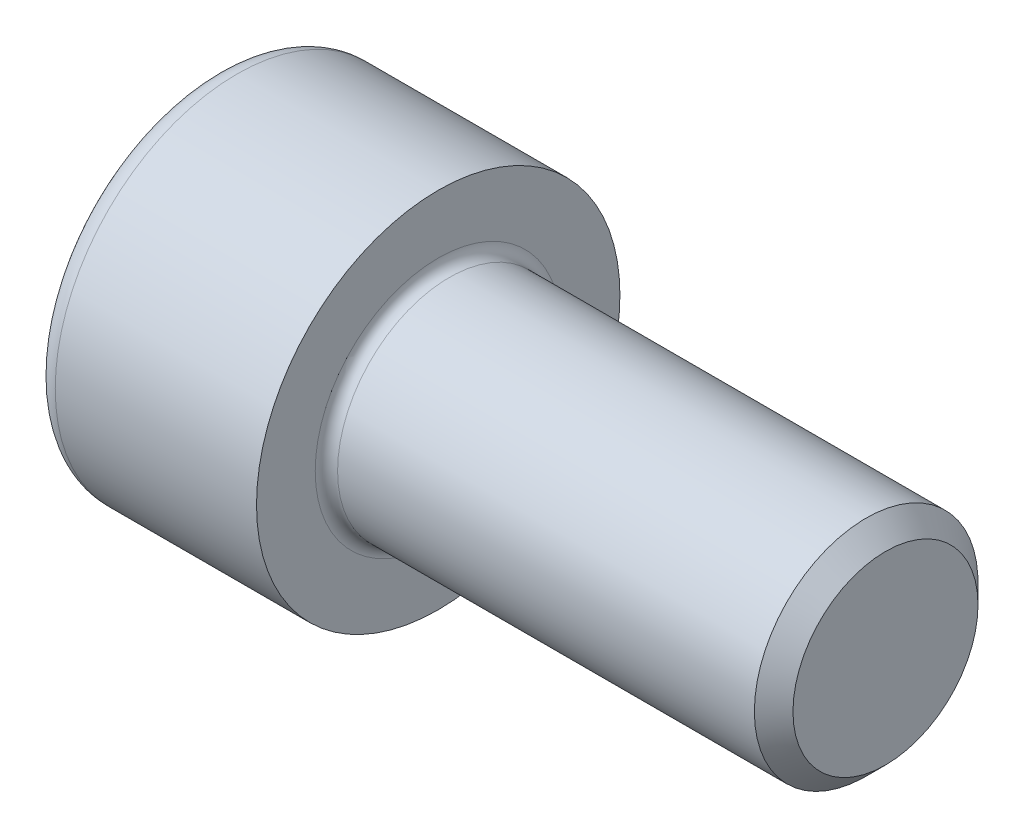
ISO-10303-21;
HEADER;
FILE_DESCRIPTION(('STEP AP214'),'2;1');
FILE_NAME('part.step','',(''),(''),'','','');
FILE_SCHEMA(('AUTOMOTIVE_DESIGN { 1 0 10303 214 1 1 1 1 }'));
ENDSEC;
DATA;
#1=APPLICATION_CONTEXT('core data for automotive mechanical design processes');
#2=APPLICATION_PROTOCOL_DEFINITION('international standard','automotive_design',2000,#1);
#3=PRODUCT_CONTEXT('',#1,'mechanical');
#4=PRODUCT('Part','Part','',(#3));
#5=PRODUCT_RELATED_PRODUCT_CATEGORY('part','',(#4));
#6=PRODUCT_DEFINITION_FORMATION('','',#4);
#7=PRODUCT_DEFINITION_CONTEXT('part definition',#1,'design');
#8=PRODUCT_DEFINITION('design','',#6,#7);
#9=PRODUCT_DEFINITION_SHAPE('','',#8);
#10=(LENGTH_UNIT() NAMED_UNIT(*) SI_UNIT(.MILLI.,.METRE.));
#11=(NAMED_UNIT(*) PLANE_ANGLE_UNIT() SI_UNIT($,.RADIAN.));
#12=(NAMED_UNIT(*) SI_UNIT($,.STERADIAN.) SOLID_ANGLE_UNIT());
#13=UNCERTAINTY_MEASURE_WITH_UNIT(LENGTH_MEASURE(1.E-05),#10,'distance_accuracy_value','');
#14=(GEOMETRIC_REPRESENTATION_CONTEXT(3) GLOBAL_UNCERTAINTY_ASSIGNED_CONTEXT((#13)) GLOBAL_UNIT_ASSIGNED_CONTEXT((#10,
#11,#12)) REPRESENTATION_CONTEXT('',''));
#15=CARTESIAN_POINT('',(0.,0.,0.));
#16=DIRECTION('',(0.,0.,1.));
#17=DIRECTION('',(1.,0.,0.));
#18=AXIS2_PLACEMENT_3D('',#15,#16,#17);
#19=CARTESIAN_POINT('',(0.,0.,0.));
#20=DIRECTION('',(-1.,0.,0.));
#21=DIRECTION('',(0.,0.,1.));
#22=AXIS2_PLACEMENT_3D('',#19,#20,#21);
#23=PLANE('',#22);
#24=DIRECTION('',(0.,-0.499999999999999,0.866025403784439));
#25=VECTOR('',#24,1.);
#26=CARTESIAN_POINT('',(0.,3.47564862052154,0.));
#27=LINE('',#26,#25);
#28=CARTESIAN_POINT('',(0.,3.47564862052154,0.));
#29=VERTEX_POINT('',#28);
#30=CARTESIAN_POINT('',(0.,1.73782431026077,3.00999999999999));
#31=VERTEX_POINT('',#30);
#32=EDGE_CURVE('E295',#29,#31,#27,.T.);
#33=ORIENTED_EDGE('',*,*,#32,.T.);
#34=DIRECTION('',(0.,1.,0.));
#35=VECTOR('',#34,1.);
#36=CARTESIAN_POINT('',(0.,-1.73782431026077,3.01));
#37=LINE('',#36,#35);
#38=CARTESIAN_POINT('',(0.,-1.73782431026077,3.01));
#39=VERTEX_POINT('',#38);
#40=EDGE_CURVE('E139',#39,#31,#37,.T.);
#41=ORIENTED_EDGE('',*,*,#40,.F.);
#42=DIRECTION('',(0.,-0.500000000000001,-0.866025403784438));
#43=VECTOR('',#42,1.);
#44=CARTESIAN_POINT('',(0.,-1.73782431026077,3.01));
#45=LINE('',#44,#43);
#46=CARTESIAN_POINT('',(0.,-3.47564862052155,0.));
#47=VERTEX_POINT('',#46);
#48=EDGE_CURVE('E300',#39,#47,#45,.T.);
#49=ORIENTED_EDGE('',*,*,#48,.T.);
#50=DIRECTION('',(0.,0.499999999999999,-0.866025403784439));
#51=VECTOR('',#50,1.);
#52=CARTESIAN_POINT('',(0.,-3.47564862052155,0.));
#53=LINE('',#52,#51);
#54=CARTESIAN_POINT('',(0.,-1.73782431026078,-3.01));
#55=VERTEX_POINT('',#54);
#56=EDGE_CURVE('E304',#47,#55,#53,.T.);
#57=ORIENTED_EDGE('',*,*,#56,.T.);
#58=DIRECTION('',(0.,-1.,0.));
#59=VECTOR('',#58,1.);
#60=CARTESIAN_POINT('',(0.,1.73782431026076,-3.01));
#61=LINE('',#60,#59);
#62=CARTESIAN_POINT('',(0.,1.73782431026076,-3.01));
#63=VERTEX_POINT('',#62);
#64=EDGE_CURVE('E308',#63,#55,#61,.T.);
#65=ORIENTED_EDGE('',*,*,#64,.F.);
#66=DIRECTION('',(0.,-0.500000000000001,-0.866025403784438));
#67=VECTOR('',#66,1.);
#68=CARTESIAN_POINT('',(0.,3.47564862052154,0.));
#69=LINE('',#68,#67);
#70=EDGE_CURVE('E134',#29,#63,#69,.T.);
#71=ORIENTED_EDGE('',*,*,#70,.F.);
#72=EDGE_LOOP('',(#33,#41,#49,#57,#65,#71));
#73=FACE_BOUND('',#72,.T.);
#74=CARTESIAN_POINT('',(0.,0.,0.));
#75=DIRECTION('',(-1.,0.,0.));
#76=DIRECTION('',(0.,0.,1.));
#77=AXIS2_PLACEMENT_3D('',#74,#75,#76);
#78=CIRCLE('',#77,5.7);
#79=CARTESIAN_POINT('',(0.,0.,5.7));
#80=VERTEX_POINT('',#79);
#81=EDGE_CURVE('E53',#80,#80,#78,.T.);
#82=ORIENTED_EDGE('',*,*,#81,.T.);
#83=EDGE_LOOP('',(#82));
#84=FACE_BOUND('',#83,.T.);
#85=ADVANCED_FACE('F44',(#73,#84),#23,.T.);
#86=CARTESIAN_POINT('',(-31.75,0.,0.));
#87=DIRECTION('',(-1.,0.,0.));
#88=DIRECTION('',(0.,0.,1.));
#89=AXIS2_PLACEMENT_3D('',#86,#87,#88);
#90=CYLINDRICAL_SURFACE('',#89,6.5);
#91=CARTESIAN_POINT('',(0.800000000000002,0.,0.));
#92=DIRECTION('',(-1.,0.,0.));
#93=DIRECTION('',(0.,0.,1.));
#94=AXIS2_PLACEMENT_3D('',#91,#92,#93);
#95=CIRCLE('',#94,6.5);
#96=CARTESIAN_POINT('',(0.800000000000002,0.,6.5));
#97=VERTEX_POINT('',#96);
#98=EDGE_CURVE('E11',#97,#97,#95,.F.);
#99=ORIENTED_EDGE('',*,*,#98,.T.);
#100=EDGE_LOOP('',(#99));
#101=FACE_BOUND('',#100,.T.);
#102=CARTESIAN_POINT('',(8.,0.,0.));
#103=DIRECTION('',(-1.,0.,0.));
#104=DIRECTION('',(0.,0.,1.));
#105=AXIS2_PLACEMENT_3D('',#102,#103,#104);
#106=CIRCLE('',#105,6.5);
#107=CARTESIAN_POINT('',(8.,0.,6.5));
#108=VERTEX_POINT('',#107);
#109=EDGE_CURVE('E163',#108,#108,#106,.T.);
#110=ORIENTED_EDGE('',*,*,#109,.T.);
#111=EDGE_LOOP('',(#110));
#112=FACE_BOUND('',#111,.T.);
#113=ADVANCED_FACE('F191',(#101,#112),#90,.T.);
#114=CARTESIAN_POINT('',(8.,6.5,0.));
#115=DIRECTION('',(1.,0.,0.));
#116=DIRECTION('',(0.,0.,-1.));
#117=AXIS2_PLACEMENT_3D('',#114,#115,#116);
#118=PLANE('',#117);
#119=CARTESIAN_POINT('',(8.,0.,0.));
#120=DIRECTION('',(1.,0.,0.));
#121=DIRECTION('',(0.,0.,-1.));
#122=AXIS2_PLACEMENT_3D('',#119,#120,#121);
#123=CIRCLE('',#122,4.4);
#124=CARTESIAN_POINT('',(8.,0.,-4.4));
#125=VERTEX_POINT('',#124);
#126=EDGE_CURVE('E167',#125,#125,#123,.F.);
#127=ORIENTED_EDGE('',*,*,#126,.T.);
#128=EDGE_LOOP('',(#127));
#129=FACE_BOUND('',#128,.T.);
#130=ORIENTED_EDGE('',*,*,#109,.F.);
#131=EDGE_LOOP('',(#130));
#132=FACE_BOUND('',#131,.T.);
#133=ADVANCED_FACE('F197',(#129,#132),#118,.T.);
#134=CARTESIAN_POINT('',(-31.75,0.,0.));
#135=DIRECTION('',(-1.,0.,0.));
#136=DIRECTION('',(0.,0.,1.));
#137=AXIS2_PLACEMENT_3D('',#134,#135,#136);
#138=CYLINDRICAL_SURFACE('',#137,4.);
#139=CARTESIAN_POINT('',(8.4,0.,0.));
#140=DIRECTION('',(1.,0.,0.));
#141=DIRECTION('',(0.,0.,-1.));
#142=AXIS2_PLACEMENT_3D('',#139,#140,#141);
#143=CIRCLE('',#142,4.);
#144=CARTESIAN_POINT('',(8.4,0.,-4.));
#145=VERTEX_POINT('',#144);
#146=EDGE_CURVE('E171',#145,#145,#143,.T.);
#147=ORIENTED_EDGE('',*,*,#146,.T.);
#148=EDGE_LOOP('',(#147));
#149=FACE_BOUND('',#148,.T.);
#150=CARTESIAN_POINT('',(23.3095,0.,0.));
#151=DIRECTION('',(-1.,0.,0.));
#152=DIRECTION('',(0.,0.,1.));
#153=AXIS2_PLACEMENT_3D('',#150,#151,#152);
#154=CIRCLE('',#153,4.);
#155=CARTESIAN_POINT('',(23.3095,0.,4.));
#156=VERTEX_POINT('',#155);
#157=EDGE_CURVE('E159',#156,#156,#154,.T.);
#158=ORIENTED_EDGE('',*,*,#157,.T.);
#159=EDGE_LOOP('',(#158));
#160=FACE_BOUND('',#159,.T.);
#161=ADVANCED_FACE('F203',(#149,#160),#138,.T.);
#162=CARTESIAN_POINT('',(24.,0.,0.));
#163=DIRECTION('',(-1.,0.,0.));
#164=DIRECTION('',(0.,0.,1.));
#165=AXIS2_PLACEMENT_3D('',#162,#163,#164);
#166=CONICAL_SURFACE('',#165,3.3095,0.785398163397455);
#167=ORIENTED_EDGE('',*,*,#157,.F.);
#168=EDGE_LOOP('',(#167));
#169=FACE_BOUND('',#168,.T.);
#170=CARTESIAN_POINT('',(24.,0.,0.));
#171=DIRECTION('',(-1.,0.,0.));
#172=DIRECTION('',(0.,0.,1.));
#173=AXIS2_PLACEMENT_3D('',#170,#171,#172);
#174=CIRCLE('',#173,3.3095);
#175=CARTESIAN_POINT('',(24.,0.,3.3095));
#176=VERTEX_POINT('',#175);
#177=EDGE_CURVE('E154',#176,#176,#174,.T.);
#178=ORIENTED_EDGE('',*,*,#177,.T.);
#179=EDGE_LOOP('',(#178));
#180=FACE_BOUND('',#179,.T.);
#181=ADVANCED_FACE('F207',(#169,#180),#166,.T.);
#182=CARTESIAN_POINT('',(24.,3.3095,0.));
#183=DIRECTION('',(1.,0.,0.));
#184=DIRECTION('',(0.,0.,-1.));
#185=AXIS2_PLACEMENT_3D('',#182,#183,#184);
#186=PLANE('',#185);
#187=ORIENTED_EDGE('',*,*,#177,.F.);
#188=EDGE_LOOP('',(#187));
#189=FACE_BOUND('',#188,.T.);
#190=ADVANCED_FACE('F187',(#189),#186,.T.);
#191=CARTESIAN_POINT('',(8.4,0.,0.));
#192=DIRECTION('',(1.,0.,0.));
#193=DIRECTION('',(0.,0.,-1.));
#194=AXIS2_PLACEMENT_3D('',#191,#192,#193);
#195=TOROIDAL_SURFACE('',#194,4.4,0.4);
#196=ORIENTED_EDGE('',*,*,#146,.F.);
#197=EDGE_LOOP('',(#196));
#198=FACE_BOUND('',#197,.T.);
#199=ORIENTED_EDGE('',*,*,#126,.F.);
#200=EDGE_LOOP('',(#199));
#201=FACE_BOUND('',#200,.T.);
#202=ADVANCED_FACE('F180',(#198,#201),#195,.F.);
#203=CARTESIAN_POINT('',(0.800000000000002,0.,0.));
#204=DIRECTION('',(-1.,0.,0.));
#205=DIRECTION('',(0.,0.,1.));
#206=AXIS2_PLACEMENT_3D('',#203,#204,#205);
#207=TOROIDAL_SURFACE('',#206,5.7,0.8);
#208=ORIENTED_EDGE('',*,*,#98,.F.);
#209=EDGE_LOOP('',(#208));
#210=FACE_BOUND('',#209,.T.);
#211=ORIENTED_EDGE('',*,*,#81,.F.);
#212=EDGE_LOOP('',(#211));
#213=FACE_BOUND('',#212,.T.);
#214=ADVANCED_FACE('F46',(#210,#213),#207,.T.);
#215=CARTESIAN_POINT('',(4.,3.47564862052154,0.));
#216=DIRECTION('',(0.,-0.866025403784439,-0.499999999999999));
#217=DIRECTION('',(0.,0.499999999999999,-0.866025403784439));
#218=AXIS2_PLACEMENT_3D('',#215,#216,#217);
#219=PLANE('',#218);
#220=ORIENTED_EDGE('',*,*,#32,.F.);
#221=DIRECTION('',(-1.,0.,0.));
#222=VECTOR('',#221,1.);
#223=CARTESIAN_POINT('',(4.,3.47564862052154,0.));
#224=LINE('',#223,#222);
#225=CARTESIAN_POINT('',(4.,3.47564862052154,0.));
#226=VERTEX_POINT('',#225);
#227=EDGE_CURVE('E294',#226,#29,#224,.T.);
#228=ORIENTED_EDGE('',*,*,#227,.F.);
#229=DIRECTION('',(0.,-0.499999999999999,0.866025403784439));
#230=VECTOR('',#229,1.);
#231=CARTESIAN_POINT('',(4.,3.47564862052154,0.));
#232=LINE('',#231,#230);
#233=CARTESIAN_POINT('',(4.,2.60673646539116,1.505));
#234=VERTEX_POINT('',#233);
#235=EDGE_CURVE('E60',#226,#234,#232,.T.);
#236=ORIENTED_EDGE('',*,*,#235,.T.);
#237=CARTESIAN_POINT('',(4.,1.73782431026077,3.00999999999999));
#238=VERTEX_POINT('',#237);
#239=EDGE_CURVE('E118',#234,#238,#232,.T.);
#240=ORIENTED_EDGE('',*,*,#239,.T.);
#241=DIRECTION('',(-1.,0.,0.));
#242=VECTOR('',#241,1.);
#243=CARTESIAN_POINT('',(4.,1.73782431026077,3.00999999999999));
#244=LINE('',#243,#242);
#245=EDGE_CURVE('E131',#238,#31,#244,.T.);
#246=ORIENTED_EDGE('',*,*,#245,.T.);
#247=EDGE_LOOP('',(#220,#228,#236,#240,#246));
#248=FACE_BOUND('',#247,.T.);
#249=ADVANCED_FACE('F130',(#248),#219,.T.);
#250=CARTESIAN_POINT('',(4.,-1.73782431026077,3.01));
#251=DIRECTION('',(0.,0.,1.));
#252=DIRECTION('',(0.,-1.,0.));
#253=AXIS2_PLACEMENT_3D('',#250,#251,#252);
#254=PLANE('',#253);
#255=ORIENTED_EDGE('',*,*,#40,.T.);
#256=ORIENTED_EDGE('',*,*,#245,.F.);
#257=DIRECTION('',(0.,1.,0.));
#258=VECTOR('',#257,1.);
#259=CARTESIAN_POINT('',(4.,-1.73782431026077,3.01));
#260=LINE('',#259,#258);
#261=CARTESIAN_POINT('',(4.,0.,3.00999999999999));
#262=VERTEX_POINT('',#261);
#263=EDGE_CURVE('E116',#262,#238,#260,.T.);
#264=ORIENTED_EDGE('',*,*,#263,.F.);
#265=CARTESIAN_POINT('',(4.,-1.73782431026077,3.01));
#266=VERTEX_POINT('',#265);
#267=EDGE_CURVE('E127',#266,#262,#260,.T.);
#268=ORIENTED_EDGE('',*,*,#267,.F.);
#269=DIRECTION('',(-1.,0.,0.));
#270=VECTOR('',#269,1.);
#271=CARTESIAN_POINT('',(4.,-1.73782431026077,3.01));
#272=LINE('',#271,#270);
#273=EDGE_CURVE('E142',#266,#39,#272,.T.);
#274=ORIENTED_EDGE('',*,*,#273,.T.);
#275=EDGE_LOOP('',(#255,#256,#264,#268,#274));
#276=FACE_BOUND('',#275,.T.);
#277=ADVANCED_FACE('F136',(#276),#254,.F.);
#278=CARTESIAN_POINT('',(4.,-1.73782431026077,3.01));
#279=DIRECTION('',(0.,0.866025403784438,-0.500000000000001));
#280=DIRECTION('',(0.,0.500000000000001,0.866025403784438));
#281=AXIS2_PLACEMENT_3D('',#278,#279,#280);
#282=PLANE('',#281);
#283=ORIENTED_EDGE('',*,*,#48,.F.);
#284=ORIENTED_EDGE('',*,*,#273,.F.);
#285=DIRECTION('',(0.,-0.500000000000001,-0.866025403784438));
#286=VECTOR('',#285,1.);
#287=CARTESIAN_POINT('',(4.,-1.73782431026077,3.01));
#288=LINE('',#287,#286);
#289=CARTESIAN_POINT('',(4.,-2.60673646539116,1.505));
#290=VERTEX_POINT('',#289);
#291=EDGE_CURVE('E269',#266,#290,#288,.T.);
#292=ORIENTED_EDGE('',*,*,#291,.T.);
#293=CARTESIAN_POINT('',(4.,-3.47564862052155,0.));
#294=VERTEX_POINT('',#293);
#295=EDGE_CURVE('E271',#290,#294,#288,.T.);
#296=ORIENTED_EDGE('',*,*,#295,.T.);
#297=DIRECTION('',(-1.,0.,0.));
#298=VECTOR('',#297,1.);
#299=CARTESIAN_POINT('',(4.,-3.47564862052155,0.));
#300=LINE('',#299,#298);
#301=EDGE_CURVE('E149',#294,#47,#300,.T.);
#302=ORIENTED_EDGE('',*,*,#301,.T.);
#303=EDGE_LOOP('',(#283,#284,#292,#296,#302));
#304=FACE_BOUND('',#303,.T.);
#305=ADVANCED_FACE('F220',(#304),#282,.T.);
#306=CARTESIAN_POINT('',(4.,-3.47564862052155,0.));
#307=DIRECTION('',(0.,0.866025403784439,0.499999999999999));
#308=DIRECTION('',(0.,-0.499999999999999,0.866025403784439));
#309=AXIS2_PLACEMENT_3D('',#306,#307,#308);
#310=PLANE('',#309);
#311=ORIENTED_EDGE('',*,*,#56,.F.);
#312=ORIENTED_EDGE('',*,*,#301,.F.);
#313=DIRECTION('',(0.,0.499999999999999,-0.866025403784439));
#314=VECTOR('',#313,1.);
#315=CARTESIAN_POINT('',(4.,-3.47564862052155,0.));
#316=LINE('',#315,#314);
#317=CARTESIAN_POINT('',(4.,-2.60673646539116,-1.505));
#318=VERTEX_POINT('',#317);
#319=EDGE_CURVE('E274',#294,#318,#316,.T.);
#320=ORIENTED_EDGE('',*,*,#319,.T.);
#321=CARTESIAN_POINT('',(4.,-1.73782431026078,-3.01));
#322=VERTEX_POINT('',#321);
#323=EDGE_CURVE('E280',#318,#322,#316,.T.);
#324=ORIENTED_EDGE('',*,*,#323,.T.);
#325=DIRECTION('',(-1.,0.,0.));
#326=VECTOR('',#325,1.);
#327=CARTESIAN_POINT('',(4.,-1.73782431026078,-3.01));
#328=LINE('',#327,#326);
#329=EDGE_CURVE('E321',#322,#55,#328,.T.);
#330=ORIENTED_EDGE('',*,*,#329,.T.);
#331=EDGE_LOOP('',(#311,#312,#320,#324,#330));
#332=FACE_BOUND('',#331,.T.);
#333=ADVANCED_FACE('F223',(#332),#310,.T.);
#334=CARTESIAN_POINT('',(4.,1.73782431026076,-3.01));
#335=DIRECTION('',(0.,0.,-1.));
#336=DIRECTION('',(0.,1.,0.));
#337=AXIS2_PLACEMENT_3D('',#334,#335,#336);
#338=PLANE('',#337);
#339=ORIENTED_EDGE('',*,*,#64,.T.);
#340=ORIENTED_EDGE('',*,*,#329,.F.);
#341=DIRECTION('',(0.,-1.,0.));
#342=VECTOR('',#341,1.);
#343=CARTESIAN_POINT('',(4.,1.73782431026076,-3.01));
#344=LINE('',#343,#342);
#345=CARTESIAN_POINT('',(4.,0.,-3.01));
#346=VERTEX_POINT('',#345);
#347=EDGE_CURVE('E286',#346,#322,#344,.T.);
#348=ORIENTED_EDGE('',*,*,#347,.F.);
#349=CARTESIAN_POINT('',(4.,1.73782431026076,-3.01));
#350=VERTEX_POINT('',#349);
#351=EDGE_CURVE('E287',#350,#346,#344,.T.);
#352=ORIENTED_EDGE('',*,*,#351,.F.);
#353=DIRECTION('',(-1.,0.,0.));
#354=VECTOR('',#353,1.);
#355=CARTESIAN_POINT('',(4.,1.73782431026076,-3.01));
#356=LINE('',#355,#354);
#357=EDGE_CURVE('E317',#350,#63,#356,.T.);
#358=ORIENTED_EDGE('',*,*,#357,.T.);
#359=EDGE_LOOP('',(#339,#340,#348,#352,#358));
#360=FACE_BOUND('',#359,.T.);
#361=ADVANCED_FACE('F227',(#360),#338,.F.);
#362=CARTESIAN_POINT('',(4.,3.47564862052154,0.));
#363=DIRECTION('',(0.,0.866025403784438,-0.500000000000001));
#364=DIRECTION('',(0.,0.500000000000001,0.866025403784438));
#365=AXIS2_PLACEMENT_3D('',#362,#363,#364);
#366=PLANE('',#365);
#367=ORIENTED_EDGE('',*,*,#70,.T.);
#368=ORIENTED_EDGE('',*,*,#357,.F.);
#369=DIRECTION('',(0.,-0.500000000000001,-0.866025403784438));
#370=VECTOR('',#369,1.);
#371=CARTESIAN_POINT('',(4.,3.47564862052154,0.));
#372=LINE('',#371,#370);
#373=CARTESIAN_POINT('',(4.,2.60673646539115,-1.505));
#374=VERTEX_POINT('',#373);
#375=EDGE_CURVE('E291',#374,#350,#372,.T.);
#376=ORIENTED_EDGE('',*,*,#375,.F.);
#377=EDGE_CURVE('E259',#226,#374,#372,.T.);
#378=ORIENTED_EDGE('',*,*,#377,.F.);
#379=ORIENTED_EDGE('',*,*,#227,.T.);
#380=EDGE_LOOP('',(#367,#368,#376,#378,#379));
#381=FACE_BOUND('',#380,.T.);
#382=ADVANCED_FACE('F231',(#381),#366,.F.);
#383=CARTESIAN_POINT('',(4.,1.73782431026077,3.00999999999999));
#384=DIRECTION('',(-1.,0.,0.));
#385=DIRECTION('',(0.,0.,1.));
#386=AXIS2_PLACEMENT_3D('',#383,#384,#385);
#387=PLANE('',#386);
#388=CARTESIAN_POINT('',(4.,0.,0.));
#389=DIRECTION('',(-1.,0.,0.));
#390=DIRECTION('',(0.,0.,1.));
#391=AXIS2_PLACEMENT_3D('',#388,#389,#390);
#392=CIRCLE('',#391,3.01);
#393=EDGE_CURVE('E141',#290,#262,#392,.T.);
#394=ORIENTED_EDGE('',*,*,#393,.F.);
#395=ORIENTED_EDGE('',*,*,#291,.F.);
#396=ORIENTED_EDGE('',*,*,#267,.T.);
#397=EDGE_LOOP('',(#394,#395,#396));
#398=FACE_BOUND('',#397,.T.);
#399=ADVANCED_FACE('F235',(#398),#387,.T.);
#400=EDGE_CURVE('E147',#318,#290,#392,.T.);
#401=ORIENTED_EDGE('',*,*,#400,.F.);
#402=ORIENTED_EDGE('',*,*,#319,.F.);
#403=ORIENTED_EDGE('',*,*,#295,.F.);
#404=EDGE_LOOP('',(#401,#402,#403));
#405=FACE_BOUND('',#404,.T.);
#406=ADVANCED_FACE('F238',(#405),#387,.T.);
#407=EDGE_CURVE('E333',#346,#318,#392,.T.);
#408=ORIENTED_EDGE('',*,*,#407,.F.);
#409=ORIENTED_EDGE('',*,*,#347,.T.);
#410=ORIENTED_EDGE('',*,*,#323,.F.);
#411=EDGE_LOOP('',(#408,#409,#410));
#412=FACE_BOUND('',#411,.T.);
#413=ADVANCED_FACE('F243',(#412),#387,.T.);
#414=EDGE_CURVE('E263',#374,#346,#392,.T.);
#415=ORIENTED_EDGE('',*,*,#414,.F.);
#416=ORIENTED_EDGE('',*,*,#375,.T.);
#417=ORIENTED_EDGE('',*,*,#351,.T.);
#418=EDGE_LOOP('',(#415,#416,#417));
#419=FACE_BOUND('',#418,.T.);
#420=ADVANCED_FACE('F250',(#419),#387,.T.);
#421=EDGE_CURVE('E155',#234,#374,#392,.T.);
#422=ORIENTED_EDGE('',*,*,#421,.F.);
#423=ORIENTED_EDGE('',*,*,#235,.F.);
#424=ORIENTED_EDGE('',*,*,#377,.T.);
#425=EDGE_LOOP('',(#422,#423,#424));
#426=FACE_BOUND('',#425,.T.);
#427=ADVANCED_FACE('F246',(#426),#387,.T.);
#428=EDGE_CURVE('E121',#262,#234,#392,.T.);
#429=ORIENTED_EDGE('',*,*,#428,.F.);
#430=ORIENTED_EDGE('',*,*,#263,.T.);
#431=ORIENTED_EDGE('',*,*,#239,.F.);
#432=EDGE_LOOP('',(#429,#430,#431));
#433=FACE_BOUND('',#432,.T.);
#434=ADVANCED_FACE('F117',(#433),#387,.T.);
#435=CARTESIAN_POINT('',(4.,0.,0.));
#436=DIRECTION('',(-1.,0.,0.));
#437=DIRECTION('',(0.,0.,1.));
#438=AXIS2_PLACEMENT_3D('',#435,#436,#437);
#439=CONICAL_SURFACE('',#438,3.01,1.04719755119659);
#440=CARTESIAN_POINT('',(5.73782431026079,0.,0.));
#441=VERTEX_POINT('',#440);
#442=VERTEX_LOOP('',#441);
#443=FACE_BOUND('',#442,.T.);
#444=ORIENTED_EDGE('',*,*,#428,.T.);
#445=ORIENTED_EDGE('',*,*,#421,.T.);
#446=ORIENTED_EDGE('',*,*,#414,.T.);
#447=ORIENTED_EDGE('',*,*,#407,.T.);
#448=ORIENTED_EDGE('',*,*,#400,.T.);
#449=ORIENTED_EDGE('',*,*,#393,.T.);
#450=EDGE_LOOP('',(#444,#445,#446,#447,#448,#449));
#451=FACE_BOUND('',#450,.T.);
#452=ADVANCED_FACE('F215',(#443,#451),#439,.F.);
#453=CLOSED_SHELL('',(#85,#113,#133,#161,#181,#190,#202,#214,#249,#277,#305,#333,#361,#382,#399,
#406,#413,#420,#427,#434,#452));
#454=MANIFOLD_SOLID_BREP('B2',#453);
#455=ADVANCED_BREP_SHAPE_REPRESENTATION('',(#18,#454),#14);
#456=SHAPE_DEFINITION_REPRESENTATION(#9,#455);
ENDSEC;
END-ISO-10303-21;
